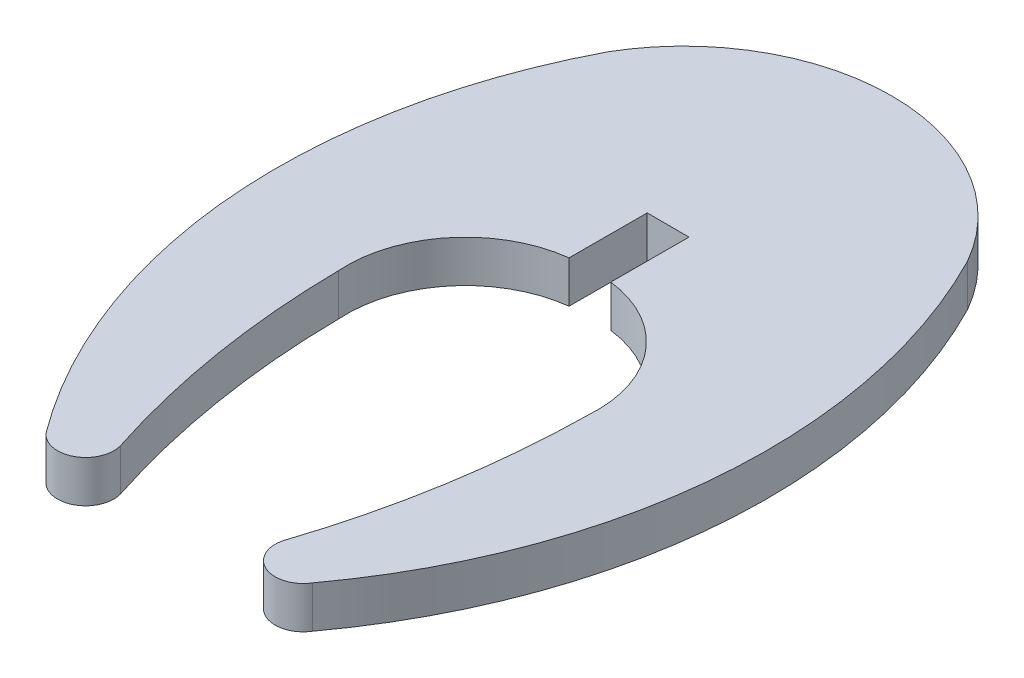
ISO-10303-21;
HEADER;
FILE_DESCRIPTION(('STEP AP214'),'2;1');
FILE_NAME('part.step','',(''),(''),'','','');
FILE_SCHEMA(('AUTOMOTIVE_DESIGN { 1 0 10303 214 1 1 1 1 }'));
ENDSEC;
DATA;
#1=APPLICATION_CONTEXT('core data for automotive mechanical design processes');
#2=APPLICATION_PROTOCOL_DEFINITION('international standard','automotive_design',2000,#1);
#3=PRODUCT_CONTEXT('',#1,'mechanical');
#4=PRODUCT('Part','Part','',(#3));
#5=PRODUCT_RELATED_PRODUCT_CATEGORY('part','',(#4));
#6=PRODUCT_DEFINITION_FORMATION('','',#4);
#7=PRODUCT_DEFINITION_CONTEXT('part definition',#1,'design');
#8=PRODUCT_DEFINITION('design','',#6,#7);
#9=PRODUCT_DEFINITION_SHAPE('','',#8);
#10=(LENGTH_UNIT() NAMED_UNIT(*) SI_UNIT(.MILLI.,.METRE.));
#11=(NAMED_UNIT(*) PLANE_ANGLE_UNIT() SI_UNIT($,.RADIAN.));
#12=(NAMED_UNIT(*) SI_UNIT($,.STERADIAN.) SOLID_ANGLE_UNIT());
#13=UNCERTAINTY_MEASURE_WITH_UNIT(LENGTH_MEASURE(1.E-05),#10,'distance_accuracy_value','');
#14=(GEOMETRIC_REPRESENTATION_CONTEXT(3) GLOBAL_UNCERTAINTY_ASSIGNED_CONTEXT((#13)) GLOBAL_UNIT_ASSIGNED_CONTEXT((#10,
#11,#12)) REPRESENTATION_CONTEXT('',''));
#15=CARTESIAN_POINT('',(0.,0.,0.));
#16=DIRECTION('',(0.,0.,1.));
#17=DIRECTION('',(1.,0.,0.));
#18=AXIS2_PLACEMENT_3D('',#15,#16,#17);
#19=CARTESIAN_POINT('',(-41978.014555,3.,-18278.107615));
#20=DIRECTION('',(0.99999818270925,0.,0.00190645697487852));
#21=DIRECTION('',(0.00190645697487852,0.,-0.99999818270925));
#22=AXIS2_PLACEMENT_3D('',#19,#20,#21);
#23=PLANE('',#22);
#24=DIRECTION('',(-0.00190645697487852,0.,0.99999818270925));
#25=VECTOR('',#24,1.);
#26=CARTESIAN_POINT('',(-41978.014555,0.,-18278.107615));
#27=LINE('',#26,#25);
#28=CARTESIAN_POINT('',(-41978.003906,0.,-18283.693359));
#29=VERTEX_POINT('',#28);
#30=CARTESIAN_POINT('',(-41978.014555,0.,-18278.107615));
#31=VERTEX_POINT('',#30);
#32=EDGE_CURVE('E156',#29,#31,#27,.T.);
#33=ORIENTED_EDGE('',*,*,#32,.T.);
#34=DIRECTION('',(0.,-1.,0.));
#35=VECTOR('',#34,1.);
#36=CARTESIAN_POINT('',(-41978.014555,3.,-18278.107615));
#37=LINE('',#36,#35);
#38=CARTESIAN_POINT('',(-41978.014555,3.,-18278.107615));
#39=VERTEX_POINT('',#38);
#40=EDGE_CURVE('E11',#39,#31,#37,.T.);
#41=ORIENTED_EDGE('',*,*,#40,.F.);
#42=DIRECTION('',(-0.00190645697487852,0.,0.99999818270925));
#43=VECTOR('',#42,1.);
#44=CARTESIAN_POINT('',(-41978.014555,3.,-18278.107615));
#45=LINE('',#44,#43);
#46=CARTESIAN_POINT('',(-41978.003906,3.,-18283.693359));
#47=VERTEX_POINT('',#46);
#48=EDGE_CURVE('E178',#47,#39,#45,.T.);
#49=ORIENTED_EDGE('',*,*,#48,.F.);
#50=DIRECTION('',(0.,-1.,0.));
#51=VECTOR('',#50,1.);
#52=CARTESIAN_POINT('',(-41978.003906,3.,-18283.693359));
#53=LINE('',#52,#51);
#54=EDGE_CURVE('E152',#47,#29,#53,.T.);
#55=ORIENTED_EDGE('',*,*,#54,.T.);
#56=EDGE_LOOP('',(#33,#41,#49,#55));
#57=FACE_BOUND('',#56,.T.);
#58=ADVANCED_FACE('F36',(#57),#23,.F.);
#59=CARTESIAN_POINT('',(-41979.0463736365,3.,-18269.6810291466));
#60=DIRECTION('',(0.,-1.,0.));
#61=DIRECTION('',(0.,0.,-1.));
#62=AXIS2_PLACEMENT_3D('',#59,#60,#61);
#63=CYLINDRICAL_SURFACE('',#62,8.48952288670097);
#64=CARTESIAN_POINT('',(-41979.0463736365,0.,-18269.6810291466));
#65=DIRECTION('',(0.,-1.,0.));
#66=DIRECTION('',(0.,0.,1.));
#67=AXIS2_PLACEMENT_3D('',#64,#65,#66);
#68=CIRCLE('',#67,8.48952288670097);
#69=CARTESIAN_POINT('',(-41970.581367,0.,-18269.036311));
#70=VERTEX_POINT('',#69);
#71=EDGE_CURVE('E159',#31,#70,#68,.T.);
#72=ORIENTED_EDGE('',*,*,#71,.T.);
#73=DIRECTION('',(0.,-1.,0.));
#74=VECTOR('',#73,1.);
#75=CARTESIAN_POINT('',(-41970.581367,3.,-18269.036311));
#76=LINE('',#75,#74);
#77=CARTESIAN_POINT('',(-41970.581367,3.,-18269.036311));
#78=VERTEX_POINT('',#77);
#79=EDGE_CURVE('E44',#78,#70,#76,.T.);
#80=ORIENTED_EDGE('',*,*,#79,.F.);
#81=CARTESIAN_POINT('',(-41979.0463736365,3.,-18269.6810291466));
#82=DIRECTION('',(0.,-1.,0.));
#83=DIRECTION('',(0.,0.,1.));
#84=AXIS2_PLACEMENT_3D('',#81,#82,#83);
#85=CIRCLE('',#84,8.48952288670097);
#86=EDGE_CURVE('E107',#39,#78,#85,.T.);
#87=ORIENTED_EDGE('',*,*,#86,.F.);
#88=ORIENTED_EDGE('',*,*,#40,.T.);
#89=EDGE_LOOP('',(#72,#80,#87,#88));
#90=FACE_BOUND('',#89,.T.);
#91=ADVANCED_FACE('F256',(#90),#63,.F.);
#92=CARTESIAN_POINT('',(-42032.8945841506,3.,-18269.8590562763));
#93=DIRECTION('',(0.,-1.,0.));
#94=DIRECTION('',(0.,0.,-1.));
#95=AXIS2_PLACEMENT_3D('',#92,#93,#94);
#96=CYLINDRICAL_SURFACE('',#95,62.3186484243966);
#97=CARTESIAN_POINT('',(-42032.8945841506,0.,-18269.8590562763));
#98=DIRECTION('',(0.,-1.,0.));
#99=DIRECTION('',(0.,0.,1.));
#100=AXIS2_PLACEMENT_3D('',#97,#98,#99);
#101=CIRCLE('',#100,62.3186484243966);
#102=CARTESIAN_POINT('',(-41973.686376,0.,-18250.416782));
#103=VERTEX_POINT('',#102);
#104=EDGE_CURVE('E161',#70,#103,#101,.T.);
#105=ORIENTED_EDGE('',*,*,#104,.T.);
#106=DIRECTION('',(0.,-1.,0.));
#107=VECTOR('',#106,1.);
#108=CARTESIAN_POINT('',(-41973.686376,3.,-18250.416782));
#109=LINE('',#108,#107);
#110=CARTESIAN_POINT('',(-41973.686376,3.,-18250.416782));
#111=VERTEX_POINT('',#110);
#112=EDGE_CURVE('E197',#111,#103,#109,.T.);
#113=ORIENTED_EDGE('',*,*,#112,.F.);
#114=CARTESIAN_POINT('',(-42032.8945841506,3.,-18269.8590562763));
#115=DIRECTION('',(0.,-1.,0.));
#116=DIRECTION('',(0.,0.,1.));
#117=AXIS2_PLACEMENT_3D('',#114,#115,#116);
#118=CIRCLE('',#117,62.3186484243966);
#119=EDGE_CURVE('E205',#78,#111,#118,.T.);
#120=ORIENTED_EDGE('',*,*,#119,.F.);
#121=ORIENTED_EDGE('',*,*,#79,.T.);
#122=EDGE_LOOP('',(#105,#113,#120,#121));
#123=FACE_BOUND('',#122,.T.);
#124=ADVANCED_FACE('F203',(#123),#96,.F.);
#125=CARTESIAN_POINT('',(-41971.7584335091,3.,-18249.832309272));
#126=DIRECTION('',(0.,-1.,0.));
#127=DIRECTION('',(0.,0.,-1.));
#128=AXIS2_PLACEMENT_3D('',#125,#126,#127);
#129=CYLINDRICAL_SURFACE('',#128,2.01458944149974);
#130=CARTESIAN_POINT('',(-41971.7584335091,0.,-18249.832309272));
#131=DIRECTION('',(0.,1.,0.));
#132=DIRECTION('',(0.,0.,1.));
#133=AXIS2_PLACEMENT_3D('',#130,#131,#132);
#134=CIRCLE('',#133,2.01458944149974);
#135=CARTESIAN_POINT('',(-41970.038411,0.,-18248.783456));
#136=VERTEX_POINT('',#135);
#137=EDGE_CURVE('E163',#103,#136,#134,.T.);
#138=ORIENTED_EDGE('',*,*,#137,.T.);
#139=DIRECTION('',(0.,-1.,0.));
#140=VECTOR('',#139,1.);
#141=CARTESIAN_POINT('',(-41970.038411,3.,-18248.783456));
#142=LINE('',#141,#140);
#143=CARTESIAN_POINT('',(-41970.038411,3.,-18248.783456));
#144=VERTEX_POINT('',#143);
#145=EDGE_CURVE('E194',#144,#136,#142,.T.);
#146=ORIENTED_EDGE('',*,*,#145,.F.);
#147=CARTESIAN_POINT('',(-41971.7584335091,3.,-18249.832309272));
#148=DIRECTION('',(0.,1.,0.));
#149=DIRECTION('',(0.,0.,1.));
#150=AXIS2_PLACEMENT_3D('',#147,#148,#149);
#151=CIRCLE('',#150,2.01458944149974);
#152=EDGE_CURVE('E223',#111,#144,#151,.T.);
#153=ORIENTED_EDGE('',*,*,#152,.F.);
#154=ORIENTED_EDGE('',*,*,#112,.T.);
#155=EDGE_LOOP('',(#138,#146,#153,#154));
#156=FACE_BOUND('',#155,.T.);
#157=ADVANCED_FACE('F214',(#156),#129,.T.);
#158=CARTESIAN_POINT('',(-42003.3360082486,3.,-18273.3038001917));
#159=DIRECTION('',(0.,-1.,0.));
#160=DIRECTION('',(0.,0.,-1.));
#161=AXIS2_PLACEMENT_3D('',#158,#159,#160);
#162=CYLINDRICAL_SURFACE('',#161,41.3518713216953);
#163=CARTESIAN_POINT('',(-42003.3360082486,0.,-18273.3038001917));
#164=DIRECTION('',(0.,1.,0.));
#165=DIRECTION('',(0.,0.,1.));
#166=AXIS2_PLACEMENT_3D('',#163,#164,#165);
#167=CIRCLE('',#166,41.3518713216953);
#168=CARTESIAN_POINT('',(-41966.550728,0.,-18292.193491));
#169=VERTEX_POINT('',#168);
#170=EDGE_CURVE('E165',#136,#169,#167,.T.);
#171=ORIENTED_EDGE('',*,*,#170,.T.);
#172=DIRECTION('',(0.,-1.,0.));
#173=VECTOR('',#172,1.);
#174=CARTESIAN_POINT('',(-41966.550728,3.,-18292.193491));
#175=LINE('',#174,#173);
#176=CARTESIAN_POINT('',(-41966.550728,3.,-18292.193491));
#177=VERTEX_POINT('',#176);
#178=EDGE_CURVE('E191',#177,#169,#175,.T.);
#179=ORIENTED_EDGE('',*,*,#178,.F.);
#180=CARTESIAN_POINT('',(-42003.3360082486,3.,-18273.3038001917));
#181=DIRECTION('',(0.,1.,0.));
#182=DIRECTION('',(0.,0.,1.));
#183=AXIS2_PLACEMENT_3D('',#180,#181,#182);
#184=CIRCLE('',#183,41.3518713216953);
#185=EDGE_CURVE('E220',#144,#177,#184,.T.);
#186=ORIENTED_EDGE('',*,*,#185,.F.);
#187=ORIENTED_EDGE('',*,*,#145,.T.);
#188=EDGE_LOOP('',(#171,#179,#186,#187));
#189=FACE_BOUND('',#188,.T.);
#190=ADVANCED_FACE('F218',(#189),#162,.T.);
#191=CARTESIAN_POINT('',(-41979.499189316,3.,-18284.8027257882));
#192=DIRECTION('',(0.,-1.,0.));
#193=DIRECTION('',(0.,0.,-1.));
#194=AXIS2_PLACEMENT_3D('',#191,#192,#193);
#195=CYLINDRICAL_SURFACE('',#194,14.9092609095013);
#196=CARTESIAN_POINT('',(-41979.499189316,0.,-18284.8027257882));
#197=DIRECTION('',(0.,1.,0.));
#198=DIRECTION('',(0.,0.,1.));
#199=AXIS2_PLACEMENT_3D('',#196,#197,#198);
#200=CIRCLE('',#199,14.9092609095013);
#201=CARTESIAN_POINT('',(-41992.4218499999,0.,-18292.238511));
#202=VERTEX_POINT('',#201);
#203=EDGE_CURVE('E167',#169,#202,#200,.T.);
#204=ORIENTED_EDGE('',*,*,#203,.T.);
#205=DIRECTION('',(0.,-1.,0.));
#206=VECTOR('',#205,1.);
#207=CARTESIAN_POINT('',(-41992.4218499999,3.,-18292.238511));
#208=LINE('',#207,#206);
#209=CARTESIAN_POINT('',(-41992.4218499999,3.,-18292.238511));
#210=VERTEX_POINT('',#209);
#211=EDGE_CURVE('E188',#210,#202,#208,.T.);
#212=ORIENTED_EDGE('',*,*,#211,.F.);
#213=CARTESIAN_POINT('',(-41979.499189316,3.,-18284.8027257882));
#214=DIRECTION('',(0.,1.,0.));
#215=DIRECTION('',(0.,0.,1.));
#216=AXIS2_PLACEMENT_3D('',#213,#214,#215);
#217=CIRCLE('',#216,14.9092609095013);
#218=EDGE_CURVE('E222',#177,#210,#217,.T.);
#219=ORIENTED_EDGE('',*,*,#218,.F.);
#220=ORIENTED_EDGE('',*,*,#178,.T.);
#221=EDGE_LOOP('',(#204,#212,#219,#220));
#222=FACE_BOUND('',#221,.T.);
#223=ADVANCED_FACE('F269',(#222),#195,.T.);
#224=CARTESIAN_POINT('',(-41955.703242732,3.,-18273.2201987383));
#225=DIRECTION('',(0.,-1.,0.));
#226=DIRECTION('',(0.,0.,-1.));
#227=AXIS2_PLACEMENT_3D('',#224,#225,#226);
#228=CYLINDRICAL_SURFACE('',#227,41.3515697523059);
#229=CARTESIAN_POINT('',(-41955.703242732,0.,-18273.2201987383));
#230=DIRECTION('',(0.,1.,0.));
#231=DIRECTION('',(0.,0.,1.));
#232=AXIS2_PLACEMENT_3D('',#229,#230,#231);
#233=CIRCLE('',#232,41.3515697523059);
#234=CARTESIAN_POINT('',(-41988.869274,0.,-18248.5226949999));
#235=VERTEX_POINT('',#234);
#236=EDGE_CURVE('E169',#202,#235,#233,.T.);
#237=ORIENTED_EDGE('',*,*,#236,.T.);
#238=DIRECTION('',(0.,-1.,0.));
#239=VECTOR('',#238,1.);
#240=CARTESIAN_POINT('',(-41988.869274,3.,-18248.5226949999));
#241=LINE('',#240,#239);
#242=CARTESIAN_POINT('',(-41988.869274,3.,-18248.5226949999));
#243=VERTEX_POINT('',#242);
#244=EDGE_CURVE('E185',#243,#235,#241,.T.);
#245=ORIENTED_EDGE('',*,*,#244,.F.);
#246=CARTESIAN_POINT('',(-41955.703242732,3.,-18273.2201987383));
#247=DIRECTION('',(0.,1.,0.));
#248=DIRECTION('',(0.,0.,1.));
#249=AXIS2_PLACEMENT_3D('',#246,#247,#248);
#250=CIRCLE('',#249,41.3515697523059);
#251=EDGE_CURVE('E225',#210,#243,#250,.T.);
#252=ORIENTED_EDGE('',*,*,#251,.F.);
#253=ORIENTED_EDGE('',*,*,#211,.T.);
#254=EDGE_LOOP('',(#237,#245,#252,#253));
#255=FACE_BOUND('',#254,.T.);
#256=ADVANCED_FACE('F272',(#255),#228,.T.);
#257=CARTESIAN_POINT('',(-41987.3605882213,3.,-18249.8567467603));
#258=DIRECTION('',(0.,-1.,0.));
#259=DIRECTION('',(0.,0.,-1.));
#260=AXIS2_PLACEMENT_3D('',#257,#258,#259);
#261=CYLINDRICAL_SURFACE('',#260,2.01390835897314);
#262=CARTESIAN_POINT('',(-41987.3605882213,0.,-18249.8567467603));
#263=DIRECTION('',(0.,1.,0.));
#264=DIRECTION('',(0.,0.,1.));
#265=AXIS2_PLACEMENT_3D('',#262,#263,#264);
#266=CIRCLE('',#265,2.01390835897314);
#267=CARTESIAN_POINT('',(-41985.431754,0.,-18250.435906));
#268=VERTEX_POINT('',#267);
#269=EDGE_CURVE('E171',#235,#268,#266,.T.);
#270=ORIENTED_EDGE('',*,*,#269,.T.);
#271=DIRECTION('',(0.,-1.,0.));
#272=VECTOR('',#271,1.);
#273=CARTESIAN_POINT('',(-41985.431754,3.,-18250.435906));
#274=LINE('',#273,#272);
#275=CARTESIAN_POINT('',(-41985.431754,3.,-18250.435906));
#276=VERTEX_POINT('',#275);
#277=EDGE_CURVE('E182',#276,#268,#274,.T.);
#278=ORIENTED_EDGE('',*,*,#277,.F.);
#279=CARTESIAN_POINT('',(-41987.3605882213,3.,-18249.8567467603));
#280=DIRECTION('',(0.,1.,0.));
#281=DIRECTION('',(0.,0.,1.));
#282=AXIS2_PLACEMENT_3D('',#279,#280,#281);
#283=CIRCLE('',#282,2.01390835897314);
#284=EDGE_CURVE('E231',#243,#276,#283,.T.);
#285=ORIENTED_EDGE('',*,*,#284,.F.);
#286=ORIENTED_EDGE('',*,*,#244,.T.);
#287=EDGE_LOOP('',(#270,#278,#285,#286));
#288=FACE_BOUND('',#287,.T.);
#289=ADVANCED_FACE('F237',(#288),#261,.T.);
#290=CARTESIAN_POINT('',(-41926.1555870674,3.,-18269.6678099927));
#291=DIRECTION('',(0.,-1.,0.));
#292=DIRECTION('',(0.,0.,-1.));
#293=AXIS2_PLACEMENT_3D('',#290,#291,#292);
#294=CYLINDRICAL_SURFACE('',#293,62.3179757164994);
#295=CARTESIAN_POINT('',(-41926.1555870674,0.,-18269.6678099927));
#296=DIRECTION('',(0.,-1.,0.));
#297=DIRECTION('',(0.,0.,1.));
#298=AXIS2_PLACEMENT_3D('',#295,#296,#297);
#299=CIRCLE('',#298,62.3179757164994);
#300=CARTESIAN_POINT('',(-41988.470698,0.,-18269.070276));
#301=VERTEX_POINT('',#300);
#302=EDGE_CURVE('E173',#268,#301,#299,.T.);
#303=ORIENTED_EDGE('',*,*,#302,.T.);
#304=DIRECTION('',(0.,-1.,0.));
#305=VECTOR('',#304,1.);
#306=CARTESIAN_POINT('',(-41988.470698,3.,-18269.070276));
#307=LINE('',#306,#305);
#308=CARTESIAN_POINT('',(-41988.470698,3.,-18269.070276));
#309=VERTEX_POINT('',#308);
#310=EDGE_CURVE('E147',#309,#301,#307,.T.);
#311=ORIENTED_EDGE('',*,*,#310,.F.);
#312=CARTESIAN_POINT('',(-41926.1555870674,3.,-18269.6678099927));
#313=DIRECTION('',(0.,-1.,0.));
#314=DIRECTION('',(0.,0.,1.));
#315=AXIS2_PLACEMENT_3D('',#312,#313,#314);
#316=CIRCLE('',#315,62.3179757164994);
#317=EDGE_CURVE('E138',#276,#309,#316,.T.);
#318=ORIENTED_EDGE('',*,*,#317,.F.);
#319=ORIENTED_EDGE('',*,*,#277,.T.);
#320=EDGE_LOOP('',(#303,#311,#318,#319));
#321=FACE_BOUND('',#320,.T.);
#322=ADVANCED_FACE('F241',(#321),#294,.F.);
#323=CARTESIAN_POINT('',(-41980.0044581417,3.,-18269.6829247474));
#324=DIRECTION('',(0.,-1.,0.));
#325=DIRECTION('',(0.,0.,-1.));
#326=AXIS2_PLACEMENT_3D('',#323,#324,#325);
#327=CYLINDRICAL_SURFACE('',#326,8.4883776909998);
#328=CARTESIAN_POINT('',(-41980.0044581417,0.,-18269.6829247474));
#329=DIRECTION('',(0.,-1.,0.));
#330=DIRECTION('',(0.,0.,1.));
#331=AXIS2_PLACEMENT_3D('',#328,#329,#330);
#332=CIRCLE('',#331,8.4883776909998);
#333=CARTESIAN_POINT('',(-41981.011719,0.,-18278.111328));
#334=VERTEX_POINT('',#333);
#335=EDGE_CURVE('E146',#301,#334,#332,.T.);
#336=ORIENTED_EDGE('',*,*,#335,.T.);
#337=DIRECTION('',(0.,-1.,0.));
#338=VECTOR('',#337,1.);
#339=CARTESIAN_POINT('',(-41981.011719,3.,-18278.111328));
#340=LINE('',#339,#338);
#341=CARTESIAN_POINT('',(-41981.011719,3.,-18278.111328));
#342=VERTEX_POINT('',#341);
#343=EDGE_CURVE('E143',#342,#334,#340,.T.);
#344=ORIENTED_EDGE('',*,*,#343,.F.);
#345=CARTESIAN_POINT('',(-41980.0044581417,3.,-18269.6829247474));
#346=DIRECTION('',(0.,-1.,0.));
#347=DIRECTION('',(0.,0.,1.));
#348=AXIS2_PLACEMENT_3D('',#345,#346,#347);
#349=CIRCLE('',#348,8.4883776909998);
#350=EDGE_CURVE('E132',#309,#342,#349,.T.);
#351=ORIENTED_EDGE('',*,*,#350,.F.);
#352=ORIENTED_EDGE('',*,*,#310,.T.);
#353=EDGE_LOOP('',(#336,#344,#351,#352));
#354=FACE_BOUND('',#353,.T.);
#355=ADVANCED_FACE('F144',(#354),#327,.F.);
#356=CARTESIAN_POINT('',(-41981.,3.,-18283.701172));
#357=DIRECTION('',(-0.999997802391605,0.,-0.00209647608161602));
#358=DIRECTION('',(-0.00209647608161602,0.,0.999997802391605));
#359=AXIS2_PLACEMENT_3D('',#356,#357,#358);
#360=PLANE('',#359);
#361=DIRECTION('',(0.00209647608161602,0.,-0.999997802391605));
#362=VECTOR('',#361,1.);
#363=CARTESIAN_POINT('',(-41981.,0.,-18283.701172));
#364=LINE('',#363,#362);
#365=CARTESIAN_POINT('',(-41981.,0.,-18283.701172));
#366=VERTEX_POINT('',#365);
#367=EDGE_CURVE('E93',#334,#366,#364,.T.);
#368=ORIENTED_EDGE('',*,*,#367,.T.);
#369=DIRECTION('',(0.,-1.,0.));
#370=VECTOR('',#369,1.);
#371=CARTESIAN_POINT('',(-41981.,3.,-18283.701172));
#372=LINE('',#371,#370);
#373=CARTESIAN_POINT('',(-41981.,3.,-18283.701172));
#374=VERTEX_POINT('',#373);
#375=EDGE_CURVE('E148',#374,#366,#372,.T.);
#376=ORIENTED_EDGE('',*,*,#375,.F.);
#377=DIRECTION('',(0.00209647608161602,0.,-0.999997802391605));
#378=VECTOR('',#377,1.);
#379=CARTESIAN_POINT('',(-41981.,3.,-18283.701172));
#380=LINE('',#379,#378);
#381=EDGE_CURVE('E136',#342,#374,#380,.T.);
#382=ORIENTED_EDGE('',*,*,#381,.F.);
#383=ORIENTED_EDGE('',*,*,#343,.T.);
#384=EDGE_LOOP('',(#368,#376,#382,#383));
#385=FACE_BOUND('',#384,.T.);
#386=ADVANCED_FACE('F150',(#385),#360,.F.);
#387=CARTESIAN_POINT('',(-41978.003906,3.,-18283.693359));
#388=DIRECTION('',(0.00260771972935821,0.,-0.999996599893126));
#389=DIRECTION('',(-0.999996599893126,0.,-0.00260771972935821));
#390=AXIS2_PLACEMENT_3D('',#387,#388,#389);
#391=PLANE('',#390);
#392=DIRECTION('',(0.999996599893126,0.,0.00260771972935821));
#393=VECTOR('',#392,1.);
#394=CARTESIAN_POINT('',(-41978.003906,0.,-18283.693359));
#395=LINE('',#394,#393);
#396=EDGE_CURVE('E99',#366,#29,#395,.T.);
#397=ORIENTED_EDGE('',*,*,#396,.T.);
#398=ORIENTED_EDGE('',*,*,#54,.F.);
#399=DIRECTION('',(0.999996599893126,0.,0.00260771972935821));
#400=VECTOR('',#399,1.);
#401=CARTESIAN_POINT('',(-41978.003906,3.,-18283.693359));
#402=LINE('',#401,#400);
#403=EDGE_CURVE('E52',#374,#47,#402,.T.);
#404=ORIENTED_EDGE('',*,*,#403,.F.);
#405=ORIENTED_EDGE('',*,*,#375,.T.);
#406=EDGE_LOOP('',(#397,#398,#404,#405));
#407=FACE_BOUND('',#406,.T.);
#408=ADVANCED_FACE('F245',(#407),#391,.F.);
#409=CARTESIAN_POINT('',(-41980.0044581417,3.,-18269.6829247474));
#410=DIRECTION('',(0.,1.,0.));
#411=DIRECTION('',(0.,0.,1.));
#412=AXIS2_PLACEMENT_3D('',#409,#410,#411);
#413=PLANE('',#412);
#414=ORIENTED_EDGE('',*,*,#48,.T.);
#415=ORIENTED_EDGE('',*,*,#86,.T.);
#416=ORIENTED_EDGE('',*,*,#119,.T.);
#417=ORIENTED_EDGE('',*,*,#152,.T.);
#418=ORIENTED_EDGE('',*,*,#185,.T.);
#419=ORIENTED_EDGE('',*,*,#218,.T.);
#420=ORIENTED_EDGE('',*,*,#251,.T.);
#421=ORIENTED_EDGE('',*,*,#284,.T.);
#422=ORIENTED_EDGE('',*,*,#317,.T.);
#423=ORIENTED_EDGE('',*,*,#350,.T.);
#424=ORIENTED_EDGE('',*,*,#381,.T.);
#425=ORIENTED_EDGE('',*,*,#403,.T.);
#426=EDGE_LOOP('',(#414,#415,#416,#417,#418,#419,#420,#421,#422,#423,#424,#425));
#427=FACE_BOUND('',#426,.T.);
#428=ADVANCED_FACE('F134',(#427),#413,.T.);
#429=CARTESIAN_POINT('',(-41980.0044581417,0.,-18269.6829247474));
#430=DIRECTION('',(0.,1.,0.));
#431=DIRECTION('',(0.,0.,1.));
#432=AXIS2_PLACEMENT_3D('',#429,#430,#431);
#433=PLANE('',#432);
#434=ORIENTED_EDGE('',*,*,#32,.F.);
#435=ORIENTED_EDGE('',*,*,#396,.F.);
#436=ORIENTED_EDGE('',*,*,#367,.F.);
#437=ORIENTED_EDGE('',*,*,#335,.F.);
#438=ORIENTED_EDGE('',*,*,#302,.F.);
#439=ORIENTED_EDGE('',*,*,#269,.F.);
#440=ORIENTED_EDGE('',*,*,#236,.F.);
#441=ORIENTED_EDGE('',*,*,#203,.F.);
#442=ORIENTED_EDGE('',*,*,#170,.F.);
#443=ORIENTED_EDGE('',*,*,#137,.F.);
#444=ORIENTED_EDGE('',*,*,#104,.F.);
#445=ORIENTED_EDGE('',*,*,#71,.F.);
#446=EDGE_LOOP('',(#434,#435,#436,#437,#438,#439,#440,#441,#442,#443,#444,#445));
#447=FACE_BOUND('',#446,.T.);
#448=ADVANCED_FACE('F209',(#447),#433,.F.);
#449=CLOSED_SHELL('',(#58,#91,#124,#157,#190,#223,#256,#289,#322,#355,#386,#408,#428,#448));
#450=MANIFOLD_SOLID_BREP('B2',#449);
#451=ADVANCED_BREP_SHAPE_REPRESENTATION('',(#18,#450),#14);
#452=SHAPE_DEFINITION_REPRESENTATION(#9,#451);
ENDSEC;
END-ISO-10303-21;
